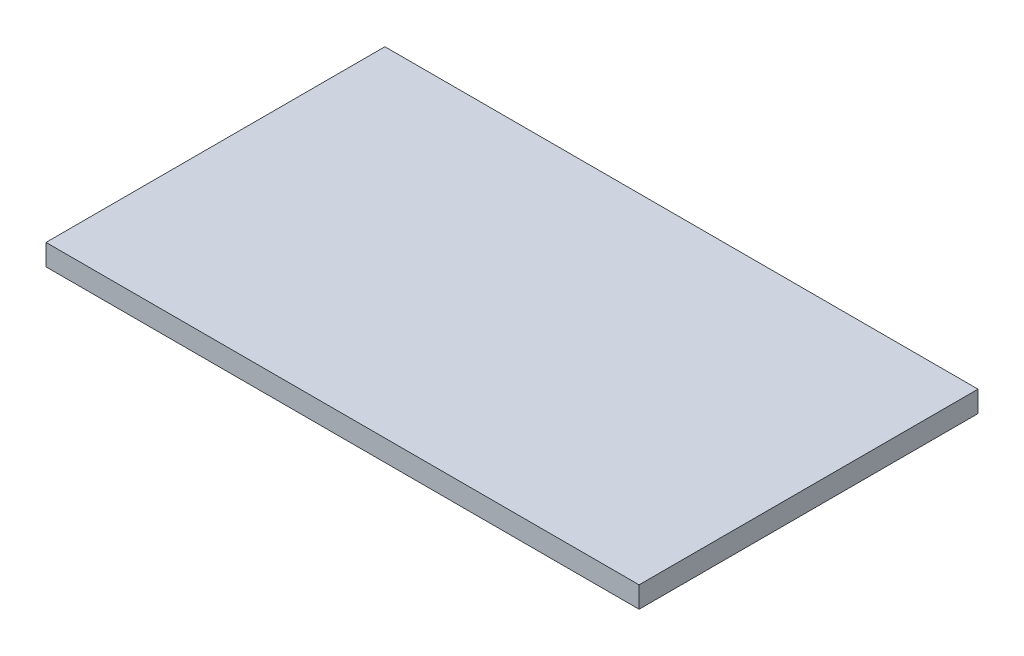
ISO-10303-21;
HEADER;
FILE_DESCRIPTION(('STEP AP214'),'2;1');
FILE_NAME('part.step','',(''),(''),'','','');
FILE_SCHEMA(('AUTOMOTIVE_DESIGN { 1 0 10303 214 1 1 1 1 }'));
ENDSEC;
DATA;
#1=APPLICATION_CONTEXT('core data for automotive mechanical design processes');
#2=APPLICATION_PROTOCOL_DEFINITION('international standard','automotive_design',2000,#1);
#3=PRODUCT_CONTEXT('',#1,'mechanical');
#4=PRODUCT('Part','Part','',(#3));
#5=PRODUCT_RELATED_PRODUCT_CATEGORY('part','',(#4));
#6=PRODUCT_DEFINITION_FORMATION('','',#4);
#7=PRODUCT_DEFINITION_CONTEXT('part definition',#1,'design');
#8=PRODUCT_DEFINITION('design','',#6,#7);
#9=PRODUCT_DEFINITION_SHAPE('','',#8);
#10=(LENGTH_UNIT() NAMED_UNIT(*) SI_UNIT(.MILLI.,.METRE.));
#11=(NAMED_UNIT(*) PLANE_ANGLE_UNIT() SI_UNIT($,.RADIAN.));
#12=(NAMED_UNIT(*) SI_UNIT($,.STERADIAN.) SOLID_ANGLE_UNIT());
#13=UNCERTAINTY_MEASURE_WITH_UNIT(LENGTH_MEASURE(1.E-05),#10,'distance_accuracy_value','');
#14=(GEOMETRIC_REPRESENTATION_CONTEXT(3) GLOBAL_UNCERTAINTY_ASSIGNED_CONTEXT((#13)) GLOBAL_UNIT_ASSIGNED_CONTEXT((#10,
#11,#12)) REPRESENTATION_CONTEXT('',''));
#15=CARTESIAN_POINT('',(0.,0.,0.));
#16=DIRECTION('',(0.,0.,1.));
#17=DIRECTION('',(1.,0.,0.));
#18=AXIS2_PLACEMENT_3D('',#15,#16,#17);
#19=CARTESIAN_POINT('',(0.,0.,-800.));
#20=DIRECTION('',(-1.,0.,0.));
#21=DIRECTION('',(0.,0.,1.));
#22=AXIS2_PLACEMENT_3D('',#19,#20,#21);
#23=PLANE('',#22);
#24=DIRECTION('',(0.,0.,1.));
#25=VECTOR('',#24,1.);
#26=CARTESIAN_POINT('',(0.,0.,-800.));
#27=LINE('',#26,#25);
#28=CARTESIAN_POINT('',(0.,0.,-800.));
#29=VERTEX_POINT('',#28);
#30=CARTESIAN_POINT('',(0.,0.,800.));
#31=VERTEX_POINT('',#30);
#32=EDGE_CURVE('E36',#29,#31,#27,.T.);
#33=ORIENTED_EDGE('',*,*,#32,.T.);
#34=DIRECTION('',(0.,-1.,0.));
#35=VECTOR('',#34,1.);
#36=CARTESIAN_POINT('',(0.,0.,800.));
#37=LINE('',#36,#35);
#38=CARTESIAN_POINT('',(0.,100.,800.));
#39=VERTEX_POINT('',#38);
#40=EDGE_CURVE('E73',#39,#31,#37,.T.);
#41=ORIENTED_EDGE('',*,*,#40,.F.);
#42=DIRECTION('',(0.,0.,1.));
#43=VECTOR('',#42,1.);
#44=CARTESIAN_POINT('',(0.,100.,-800.));
#45=LINE('',#44,#43);
#46=CARTESIAN_POINT('',(0.,100.,-800.));
#47=VERTEX_POINT('',#46);
#48=EDGE_CURVE('E11',#47,#39,#45,.T.);
#49=ORIENTED_EDGE('',*,*,#48,.F.);
#50=DIRECTION('',(0.,-1.,0.));
#51=VECTOR('',#50,1.);
#52=CARTESIAN_POINT('',(0.,0.,-800.));
#53=LINE('',#52,#51);
#54=EDGE_CURVE('E74',#47,#29,#53,.T.);
#55=ORIENTED_EDGE('',*,*,#54,.T.);
#56=EDGE_LOOP('',(#33,#41,#49,#55));
#57=FACE_BOUND('',#56,.T.);
#58=ADVANCED_FACE('F33',(#57),#23,.T.);
#59=CARTESIAN_POINT('',(0.,100.,-800.));
#60=DIRECTION('',(0.,1.,0.));
#61=DIRECTION('',(0.,0.,1.));
#62=AXIS2_PLACEMENT_3D('',#59,#60,#61);
#63=PLANE('',#62);
#64=ORIENTED_EDGE('',*,*,#48,.T.);
#65=DIRECTION('',(-1.,0.,0.));
#66=VECTOR('',#65,1.);
#67=CARTESIAN_POINT('',(0.,100.,800.));
#68=LINE('',#67,#66);
#69=CARTESIAN_POINT('',(2800.,100.,800.));
#70=VERTEX_POINT('',#69);
#71=EDGE_CURVE('E90',#70,#39,#68,.T.);
#72=ORIENTED_EDGE('',*,*,#71,.F.);
#73=DIRECTION('',(0.,0.,1.));
#74=VECTOR('',#73,1.);
#75=CARTESIAN_POINT('',(2800.,100.,-800.));
#76=LINE('',#75,#74);
#77=CARTESIAN_POINT('',(2800.,100.,-800.));
#78=VERTEX_POINT('',#77);
#79=EDGE_CURVE('E41',#78,#70,#76,.T.);
#80=ORIENTED_EDGE('',*,*,#79,.F.);
#81=DIRECTION('',(-1.,0.,0.));
#82=VECTOR('',#81,1.);
#83=CARTESIAN_POINT('',(0.,100.,-800.));
#84=LINE('',#83,#82);
#85=EDGE_CURVE('E79',#78,#47,#84,.T.);
#86=ORIENTED_EDGE('',*,*,#85,.T.);
#87=EDGE_LOOP('',(#64,#72,#80,#86));
#88=FACE_BOUND('',#87,.T.);
#89=ADVANCED_FACE('F105',(#88),#63,.T.);
#90=CARTESIAN_POINT('',(2800.,0.,-800.));
#91=DIRECTION('',(1.,0.,0.));
#92=DIRECTION('',(0.,0.,-1.));
#93=AXIS2_PLACEMENT_3D('',#90,#91,#92);
#94=PLANE('',#93);
#95=ORIENTED_EDGE('',*,*,#79,.T.);
#96=DIRECTION('',(0.,1.,0.));
#97=VECTOR('',#96,1.);
#98=CARTESIAN_POINT('',(2800.,0.,800.));
#99=LINE('',#98,#97);
#100=CARTESIAN_POINT('',(2800.,0.,800.));
#101=VERTEX_POINT('',#100);
#102=EDGE_CURVE('E86',#101,#70,#99,.T.);
#103=ORIENTED_EDGE('',*,*,#102,.F.);
#104=DIRECTION('',(0.,0.,1.));
#105=VECTOR('',#104,1.);
#106=CARTESIAN_POINT('',(2800.,0.,-800.));
#107=LINE('',#106,#105);
#108=CARTESIAN_POINT('',(2800.,0.,-800.));
#109=VERTEX_POINT('',#108);
#110=EDGE_CURVE('E78',#109,#101,#107,.T.);
#111=ORIENTED_EDGE('',*,*,#110,.F.);
#112=DIRECTION('',(0.,1.,0.));
#113=VECTOR('',#112,1.);
#114=CARTESIAN_POINT('',(2800.,0.,-800.));
#115=LINE('',#114,#113);
#116=EDGE_CURVE('E98',#109,#78,#115,.T.);
#117=ORIENTED_EDGE('',*,*,#116,.T.);
#118=EDGE_LOOP('',(#95,#103,#111,#117));
#119=FACE_BOUND('',#118,.T.);
#120=ADVANCED_FACE('F102',(#119),#94,.T.);
#121=CARTESIAN_POINT('',(0.,0.,-800.));
#122=DIRECTION('',(0.,-1.,0.));
#123=DIRECTION('',(0.,0.,-1.));
#124=AXIS2_PLACEMENT_3D('',#121,#122,#123);
#125=PLANE('',#124);
#126=ORIENTED_EDGE('',*,*,#110,.T.);
#127=DIRECTION('',(1.,0.,0.));
#128=VECTOR('',#127,1.);
#129=CARTESIAN_POINT('',(0.,0.,800.));
#130=LINE('',#129,#128);
#131=EDGE_CURVE('E81',#31,#101,#130,.T.);
#132=ORIENTED_EDGE('',*,*,#131,.F.);
#133=ORIENTED_EDGE('',*,*,#32,.F.);
#134=DIRECTION('',(1.,0.,0.));
#135=VECTOR('',#134,1.);
#136=CARTESIAN_POINT('',(0.,0.,-800.));
#137=LINE('',#136,#135);
#138=EDGE_CURVE('E96',#29,#109,#137,.T.);
#139=ORIENTED_EDGE('',*,*,#138,.T.);
#140=EDGE_LOOP('',(#126,#132,#133,#139));
#141=FACE_BOUND('',#140,.T.);
#142=ADVANCED_FACE('F82',(#141),#125,.T.);
#143=CARTESIAN_POINT('',(0.,0.,-800.));
#144=DIRECTION('',(0.,0.,-1.));
#145=DIRECTION('',(-1.,0.,0.));
#146=AXIS2_PLACEMENT_3D('',#143,#144,#145);
#147=PLANE('',#146);
#148=ORIENTED_EDGE('',*,*,#54,.F.);
#149=ORIENTED_EDGE('',*,*,#85,.F.);
#150=ORIENTED_EDGE('',*,*,#116,.F.);
#151=ORIENTED_EDGE('',*,*,#138,.F.);
#152=EDGE_LOOP('',(#148,#149,#150,#151));
#153=FACE_BOUND('',#152,.T.);
#154=ADVANCED_FACE('F107',(#153),#147,.T.);
#155=CARTESIAN_POINT('',(0.,0.,800.));
#156=DIRECTION('',(0.,0.,-1.));
#157=DIRECTION('',(-1.,0.,0.));
#158=AXIS2_PLACEMENT_3D('',#155,#156,#157);
#159=PLANE('',#158);
#160=ORIENTED_EDGE('',*,*,#40,.T.);
#161=ORIENTED_EDGE('',*,*,#131,.T.);
#162=ORIENTED_EDGE('',*,*,#102,.T.);
#163=ORIENTED_EDGE('',*,*,#71,.T.);
#164=EDGE_LOOP('',(#160,#161,#162,#163));
#165=FACE_BOUND('',#164,.T.);
#166=ADVANCED_FACE('F89',(#165),#159,.F.);
#167=CLOSED_SHELL('',(#58,#89,#120,#142,#154,#166));
#168=MANIFOLD_SOLID_BREP('B2',#167);
#169=ADVANCED_BREP_SHAPE_REPRESENTATION('',(#18,#168),#14);
#170=SHAPE_DEFINITION_REPRESENTATION(#9,#169);
ENDSEC;
END-ISO-10303-21;
